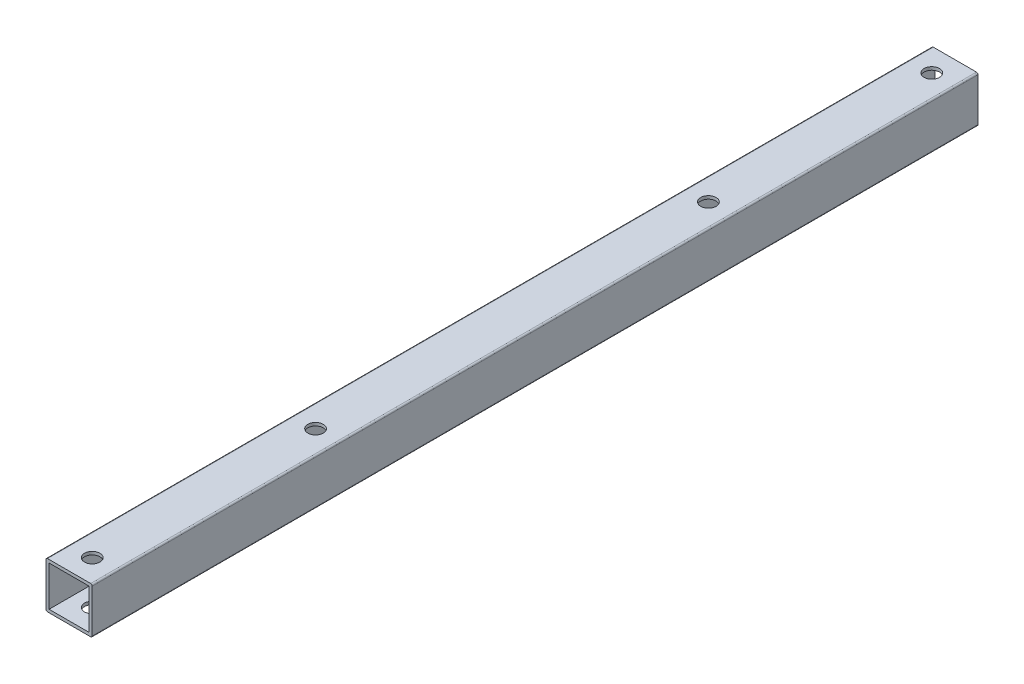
from build123d import *

# Parameters (mm, degrees)
ESQUISSE1_W             = 26
ESQUISSE1_H             = 26
BASE_EXTRU_MINCE_DEPTH  = 575
ESQUISSE2_R             = 5
ENL_V_MAT_EXTRU_1_DEPTH = 35


with BuildPart() as part:
    # Esquisse1 → Base-Extru.-Mince (new body)
    with BuildSketch(Plane.XY):
        with BuildLine():
            Line((14, -15), (-14, -15))
            ThreePointArc((-14, -15), (-14.707106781, -14.707106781), (-15, -14))
            Line((-15, -14), (-15, 14))
            ThreePointArc((-15, 14), (-14.707106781, 14.707106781), (-14, 15))
            Line((-14, 15), (14, 15))
            ThreePointArc((14, 15), (14.707106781, 14.707106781), (15, 14))
            Line((15, 14), (15, -14))
            ThreePointArc((15, -14), (14.707106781, -14.707106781), (14, -15))
        make_face()
        Rectangle(ESQUISSE1_W, ESQUISSE1_H, mode=Mode.SUBTRACT)
    extrude(amount=BASE_EXTRU_MINCE_DEPTH)

    # Esquisse2 → Enl_v. mat.-Extru.1 (cut)
    with BuildSketch(Plane(origin=(0, 15, 0), x_dir=(-1, 0, 0), z_dir=(0, 1, 0))):
        with Locations(Location((0, 15, 0), (0, 0, 90))):
            Circle(ESQUISSE2_R)
        with Locations(Location((0, 160, 0), (0, 0, 90))):
            Circle(ESQUISSE2_R)
        with Locations(Location((0, 560, 0), (0, 0, 90))):
            Circle(ESQUISSE2_R)
        with Locations(Location((0, 415, 0), (0, 0, 90))):
            Circle(ESQUISSE2_R)
    extrude(amount=-ENL_V_MAT_EXTRU_1_DEPTH, mode=Mode.SUBTRACT)


solid = part.part
